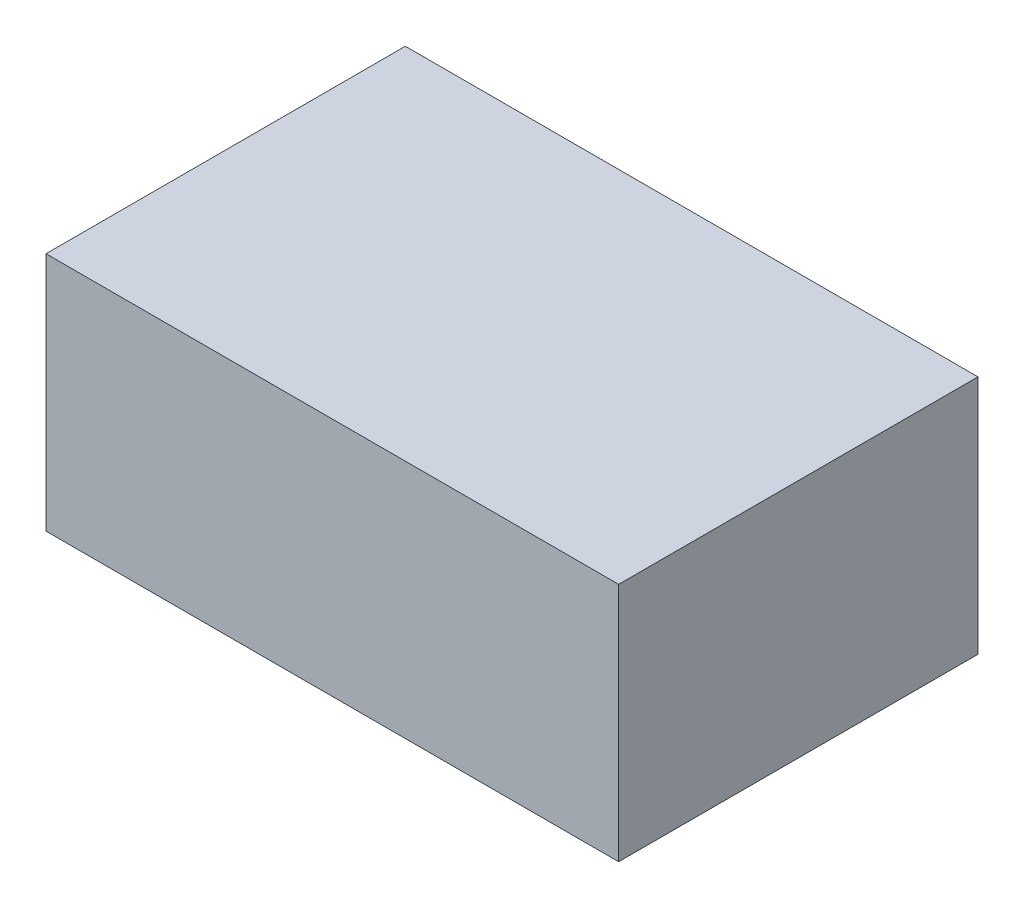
from build123d import *

# Parameters (mm, degrees)
SKETCH4_W           = 188.301157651
SKETCH4_H           = 118.163961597
BOSS_EXTRUDE2_DEPTH = 79


with BuildPart() as part:
    # Sketch4 → Boss-Extrude2 (new body)
    with BuildSketch(Plane(origin=(0, 0, 0), x_dir=(1, 0, 0), z_dir=(0, 1, 0))):
        with Locations((-94.150578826, 29.617216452)):
            Rectangle(SKETCH4_W, SKETCH4_H)
    extrude(amount=BOSS_EXTRUDE2_DEPTH)


solid = part.part
